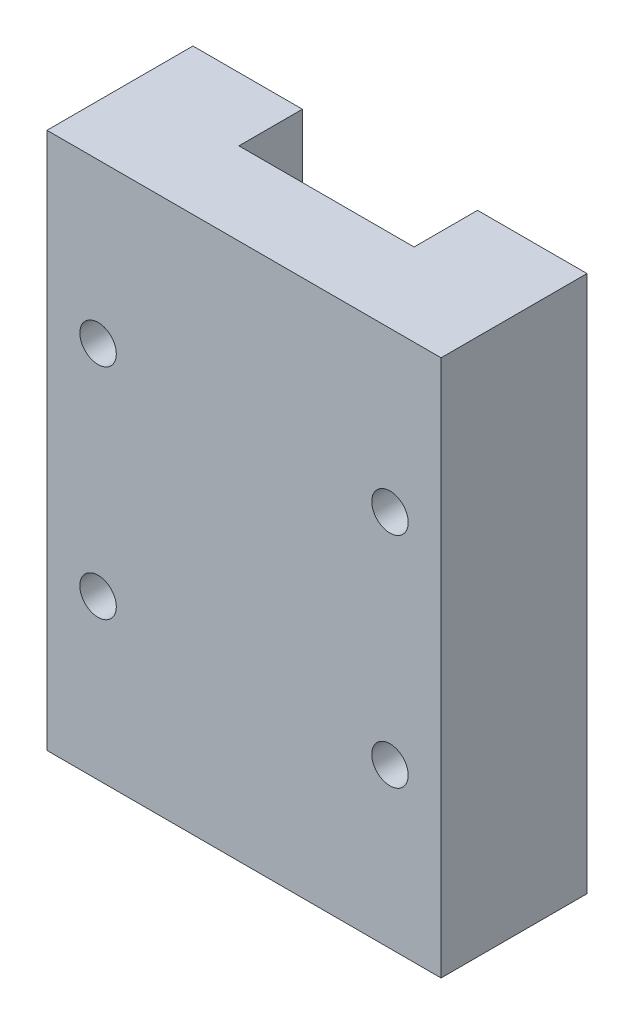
ISO-10303-21;
HEADER;
FILE_DESCRIPTION(('STEP AP214'),'2;1');
FILE_NAME('part.step','',(''),(''),'','','');
FILE_SCHEMA(('AUTOMOTIVE_DESIGN { 1 0 10303 214 1 1 1 1 }'));
ENDSEC;
DATA;
#1=APPLICATION_CONTEXT('core data for automotive mechanical design processes');
#2=APPLICATION_PROTOCOL_DEFINITION('international standard','automotive_design',2000,#1);
#3=PRODUCT_CONTEXT('',#1,'mechanical');
#4=PRODUCT('Part','Part','',(#3));
#5=PRODUCT_RELATED_PRODUCT_CATEGORY('part','',(#4));
#6=PRODUCT_DEFINITION_FORMATION('','',#4);
#7=PRODUCT_DEFINITION_CONTEXT('part definition',#1,'design');
#8=PRODUCT_DEFINITION('design','',#6,#7);
#9=PRODUCT_DEFINITION_SHAPE('','',#8);
#10=(LENGTH_UNIT() NAMED_UNIT(*) SI_UNIT(.MILLI.,.METRE.));
#11=(NAMED_UNIT(*) PLANE_ANGLE_UNIT() SI_UNIT($,.RADIAN.));
#12=(NAMED_UNIT(*) SI_UNIT($,.STERADIAN.) SOLID_ANGLE_UNIT());
#13=UNCERTAINTY_MEASURE_WITH_UNIT(LENGTH_MEASURE(1.E-05),#10,'distance_accuracy_value','');
#14=(GEOMETRIC_REPRESENTATION_CONTEXT(3) GLOBAL_UNCERTAINTY_ASSIGNED_CONTEXT((#13)) GLOBAL_UNIT_ASSIGNED_CONTEXT((#10,
#11,#12)) REPRESENTATION_CONTEXT('',''));
#15=CARTESIAN_POINT('',(0.,0.,0.));
#16=DIRECTION('',(0.,0.,1.));
#17=DIRECTION('',(1.,0.,0.));
#18=AXIS2_PLACEMENT_3D('',#15,#16,#17);
#19=CARTESIAN_POINT('',(0.,36.8000000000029,0.));
#20=DIRECTION('',(0.,0.,1.));
#21=DIRECTION('',(1.,0.,0.));
#22=AXIS2_PLACEMENT_3D('',#19,#20,#21);
#23=PLANE('',#22);
#24=CARTESIAN_POINT('',(23.5,10.9000000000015,0.));
#25=DIRECTION('',(0.,0.,1.));
#26=DIRECTION('',(1.,0.,0.));
#27=AXIS2_PLACEMENT_3D('',#24,#25,#26);
#28=CIRCLE('',#27,1.25);
#29=CARTESIAN_POINT('',(24.75,10.9000000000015,0.));
#30=VERTEX_POINT('',#29);
#31=EDGE_CURVE('E166',#30,#30,#28,.T.);
#32=ORIENTED_EDGE('',*,*,#31,.T.);
#33=EDGE_LOOP('',(#32));
#34=FACE_BOUND('',#33,.T.);
#35=CARTESIAN_POINT('',(23.5,25.9000000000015,0.));
#36=DIRECTION('',(0.,0.,1.));
#37=DIRECTION('',(1.,0.,0.));
#38=AXIS2_PLACEMENT_3D('',#35,#36,#37);
#39=CIRCLE('',#38,1.25);
#40=CARTESIAN_POINT('',(24.75,25.9000000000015,0.));
#41=VERTEX_POINT('',#40);
#42=EDGE_CURVE('E147',#41,#41,#39,.T.);
#43=ORIENTED_EDGE('',*,*,#42,.T.);
#44=EDGE_LOOP('',(#43));
#45=FACE_BOUND('',#44,.T.);
#46=DIRECTION('',(0.,-1.,0.));
#47=VECTOR('',#46,1.);
#48=CARTESIAN_POINT('',(19.4999999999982,95.2064422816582,1.36424205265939E-12));
#49=LINE('',#48,#47);
#50=CARTESIAN_POINT('',(19.4999999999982,36.8000000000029,0.));
#51=VERTEX_POINT('',#50);
#52=CARTESIAN_POINT('',(19.4999999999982,0.,0.));
#53=VERTEX_POINT('',#52);
#54=EDGE_CURVE('E175',#51,#53,#49,.T.);
#55=ORIENTED_EDGE('',*,*,#54,.F.);
#56=DIRECTION('',(-1.,0.,0.));
#57=VECTOR('',#56,1.);
#58=CARTESIAN_POINT('',(27.,36.8000000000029,0.));
#59=LINE('',#58,#57);
#60=CARTESIAN_POINT('',(27.,36.8000000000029,0.));
#61=VERTEX_POINT('',#60);
#62=EDGE_CURVE('E138',#61,#51,#59,.T.);
#63=ORIENTED_EDGE('',*,*,#62,.F.);
#64=DIRECTION('',(0.,1.,0.));
#65=VECTOR('',#64,1.);
#66=CARTESIAN_POINT('',(27.,36.8000000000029,0.));
#67=LINE('',#66,#65);
#68=CARTESIAN_POINT('',(27.,0.,0.));
#69=VERTEX_POINT('',#68);
#70=EDGE_CURVE('E107',#69,#61,#67,.T.);
#71=ORIENTED_EDGE('',*,*,#70,.F.);
#72=DIRECTION('',(1.,0.,0.));
#73=VECTOR('',#72,1.);
#74=CARTESIAN_POINT('',(27.,0.,0.));
#75=LINE('',#74,#73);
#76=EDGE_CURVE('E108',#53,#69,#75,.T.);
#77=ORIENTED_EDGE('',*,*,#76,.F.);
#78=EDGE_LOOP('',(#55,#63,#71,#77));
#79=FACE_BOUND('',#78,.T.);
#80=ADVANCED_FACE('F32',(#34,#45,#79),#23,.F.);
#81=CARTESIAN_POINT('',(3.5,25.9000000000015,0.));
#82=DIRECTION('',(0.,0.,1.));
#83=DIRECTION('',(1.,0.,0.));
#84=AXIS2_PLACEMENT_3D('',#81,#82,#83);
#85=CIRCLE('',#84,1.25);
#86=CARTESIAN_POINT('',(4.75,25.9000000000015,0.));
#87=VERTEX_POINT('',#86);
#88=EDGE_CURVE('E154',#87,#87,#85,.T.);
#89=ORIENTED_EDGE('',*,*,#88,.T.);
#90=EDGE_LOOP('',(#89));
#91=FACE_BOUND('',#90,.T.);
#92=CARTESIAN_POINT('',(3.5,10.9000000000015,0.));
#93=DIRECTION('',(0.,0.,1.));
#94=DIRECTION('',(1.,0.,0.));
#95=AXIS2_PLACEMENT_3D('',#92,#93,#94);
#96=CIRCLE('',#95,1.25);
#97=CARTESIAN_POINT('',(4.75,10.9000000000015,0.));
#98=VERTEX_POINT('',#97);
#99=EDGE_CURVE('E160',#98,#98,#96,.T.);
#100=ORIENTED_EDGE('',*,*,#99,.T.);
#101=EDGE_LOOP('',(#100));
#102=FACE_BOUND('',#101,.T.);
#103=DIRECTION('',(0.,-1.,0.));
#104=VECTOR('',#103,1.);
#105=CARTESIAN_POINT('',(7.49999999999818,95.2064422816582,1.36424205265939E-12));
#106=LINE('',#105,#104);
#107=CARTESIAN_POINT('',(7.49999999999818,36.8000000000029,0.));
#108=VERTEX_POINT('',#107);
#109=CARTESIAN_POINT('',(7.49999999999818,0.,1.36424205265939E-12));
#110=VERTEX_POINT('',#109);
#111=EDGE_CURVE('E112',#108,#110,#106,.T.);
#112=ORIENTED_EDGE('',*,*,#111,.T.);
#113=CARTESIAN_POINT('',(0.,0.,0.));
#114=VERTEX_POINT('',#113);
#115=EDGE_CURVE('E96',#114,#110,#75,.T.);
#116=ORIENTED_EDGE('',*,*,#115,.F.);
#117=DIRECTION('',(0.,-1.,0.));
#118=VECTOR('',#117,1.);
#119=CARTESIAN_POINT('',(0.,36.8000000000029,0.));
#120=LINE('',#119,#118);
#121=CARTESIAN_POINT('',(0.,36.8000000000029,0.));
#122=VERTEX_POINT('',#121);
#123=EDGE_CURVE('E136',#122,#114,#120,.T.);
#124=ORIENTED_EDGE('',*,*,#123,.F.);
#125=EDGE_CURVE('E114',#108,#122,#59,.T.);
#126=ORIENTED_EDGE('',*,*,#125,.F.);
#127=EDGE_LOOP('',(#112,#116,#124,#126));
#128=FACE_BOUND('',#127,.T.);
#129=ADVANCED_FACE('F113',(#91,#102,#128),#23,.F.);
#130=CARTESIAN_POINT('',(27.,36.8000000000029,10.));
#131=DIRECTION('',(0.,-1.,0.));
#132=DIRECTION('',(0.,0.,-1.));
#133=AXIS2_PLACEMENT_3D('',#130,#131,#132);
#134=PLANE('',#133);
#135=DIRECTION('',(0.,0.,-1.));
#136=VECTOR('',#135,1.);
#137=CARTESIAN_POINT('',(19.4999999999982,36.8000000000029,10.));
#138=LINE('',#137,#136);
#139=CARTESIAN_POINT('',(19.4999999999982,36.8000000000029,4.34999999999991));
#140=VERTEX_POINT('',#139);
#141=EDGE_CURVE('E47',#140,#51,#138,.T.);
#142=ORIENTED_EDGE('',*,*,#141,.F.);
#143=DIRECTION('',(1.,0.,0.));
#144=VECTOR('',#143,1.);
#145=CARTESIAN_POINT('',(27.,36.8000000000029,4.34999999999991));
#146=LINE('',#145,#144);
#147=CARTESIAN_POINT('',(7.49999999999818,36.8000000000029,4.34999999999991));
#148=VERTEX_POINT('',#147);
#149=EDGE_CURVE('E51',#148,#140,#146,.T.);
#150=ORIENTED_EDGE('',*,*,#149,.F.);
#151=DIRECTION('',(0.,0.,1.));
#152=VECTOR('',#151,1.);
#153=CARTESIAN_POINT('',(7.49999999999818,36.8000000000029,10.));
#154=LINE('',#153,#152);
#155=EDGE_CURVE('E173',#108,#148,#154,.T.);
#156=ORIENTED_EDGE('',*,*,#155,.F.);
#157=ORIENTED_EDGE('',*,*,#125,.T.);
#158=DIRECTION('',(0.,0.,-1.));
#159=VECTOR('',#158,1.);
#160=CARTESIAN_POINT('',(0.,36.8000000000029,10.));
#161=LINE('',#160,#159);
#162=CARTESIAN_POINT('',(0.,36.8000000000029,10.));
#163=VERTEX_POINT('',#162);
#164=EDGE_CURVE('E121',#163,#122,#161,.T.);
#165=ORIENTED_EDGE('',*,*,#164,.F.);
#166=DIRECTION('',(-1.,0.,0.));
#167=VECTOR('',#166,1.);
#168=CARTESIAN_POINT('',(27.,36.8000000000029,10.));
#169=LINE('',#168,#167);
#170=CARTESIAN_POINT('',(27.,36.8000000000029,10.));
#171=VERTEX_POINT('',#170);
#172=EDGE_CURVE('E134',#171,#163,#169,.T.);
#173=ORIENTED_EDGE('',*,*,#172,.F.);
#174=DIRECTION('',(0.,0.,-1.));
#175=VECTOR('',#174,1.);
#176=CARTESIAN_POINT('',(27.,36.8000000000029,10.));
#177=LINE('',#176,#175);
#178=EDGE_CURVE('E130',#171,#61,#177,.T.);
#179=ORIENTED_EDGE('',*,*,#178,.T.);
#180=ORIENTED_EDGE('',*,*,#62,.T.);
#181=EDGE_LOOP('',(#142,#150,#156,#157,#165,#173,#179,#180));
#182=FACE_BOUND('',#181,.T.);
#183=ADVANCED_FACE('F34',(#182),#134,.F.);
#184=CARTESIAN_POINT('',(27.,0.,10.));
#185=DIRECTION('',(0.,1.,0.));
#186=DIRECTION('',(0.,0.,1.));
#187=AXIS2_PLACEMENT_3D('',#184,#185,#186);
#188=PLANE('',#187);
#189=DIRECTION('',(0.,0.,1.));
#190=VECTOR('',#189,1.);
#191=CARTESIAN_POINT('',(19.4999999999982,0.,10.));
#192=LINE('',#191,#190);
#193=CARTESIAN_POINT('',(19.4999999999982,0.,4.34999999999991));
#194=VERTEX_POINT('',#193);
#195=EDGE_CURVE('E11',#53,#194,#192,.T.);
#196=ORIENTED_EDGE('',*,*,#195,.F.);
#197=ORIENTED_EDGE('',*,*,#76,.T.);
#198=DIRECTION('',(0.,0.,-1.));
#199=VECTOR('',#198,1.);
#200=CARTESIAN_POINT('',(27.,0.,10.));
#201=LINE('',#200,#199);
#202=CARTESIAN_POINT('',(27.,0.,10.));
#203=VERTEX_POINT('',#202);
#204=EDGE_CURVE('E127',#203,#69,#201,.T.);
#205=ORIENTED_EDGE('',*,*,#204,.F.);
#206=DIRECTION('',(1.,0.,0.));
#207=VECTOR('',#206,1.);
#208=CARTESIAN_POINT('',(27.,0.,10.));
#209=LINE('',#208,#207);
#210=CARTESIAN_POINT('',(0.,0.,10.));
#211=VERTEX_POINT('',#210);
#212=EDGE_CURVE('E141',#211,#203,#209,.T.);
#213=ORIENTED_EDGE('',*,*,#212,.F.);
#214=DIRECTION('',(0.,0.,-1.));
#215=VECTOR('',#214,1.);
#216=CARTESIAN_POINT('',(0.,0.,10.));
#217=LINE('',#216,#215);
#218=EDGE_CURVE('E104',#211,#114,#217,.T.);
#219=ORIENTED_EDGE('',*,*,#218,.T.);
#220=ORIENTED_EDGE('',*,*,#115,.T.);
#221=DIRECTION('',(0.,0.,-1.));
#222=VECTOR('',#221,1.);
#223=CARTESIAN_POINT('',(7.49999999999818,0.,10.));
#224=LINE('',#223,#222);
#225=CARTESIAN_POINT('',(7.49999999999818,0.,4.34999999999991));
#226=VERTEX_POINT('',#225);
#227=EDGE_CURVE('E100',#226,#110,#224,.T.);
#228=ORIENTED_EDGE('',*,*,#227,.F.);
#229=DIRECTION('',(-1.,0.,0.));
#230=VECTOR('',#229,1.);
#231=CARTESIAN_POINT('',(27.,0.,4.34999999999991));
#232=LINE('',#231,#230);
#233=EDGE_CURVE('E40',#194,#226,#232,.T.);
#234=ORIENTED_EDGE('',*,*,#233,.F.);
#235=EDGE_LOOP('',(#196,#197,#205,#213,#219,#220,#228,#234));
#236=FACE_BOUND('',#235,.T.);
#237=ADVANCED_FACE('F98',(#236),#188,.F.);
#238=CARTESIAN_POINT('',(0.,36.8000000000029,10.));
#239=DIRECTION('',(0.,0.,1.));
#240=DIRECTION('',(1.,0.,0.));
#241=AXIS2_PLACEMENT_3D('',#238,#239,#240);
#242=PLANE('',#241);
#243=CARTESIAN_POINT('',(3.5,10.9000000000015,10.));
#244=DIRECTION('',(0.,0.,1.));
#245=DIRECTION('',(1.,0.,0.));
#246=AXIS2_PLACEMENT_3D('',#243,#244,#245);
#247=CIRCLE('',#246,1.25);
#248=CARTESIAN_POINT('',(4.75,10.9000000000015,10.));
#249=VERTEX_POINT('',#248);
#250=EDGE_CURVE('E157',#249,#249,#247,.T.);
#251=ORIENTED_EDGE('',*,*,#250,.F.);
#252=EDGE_LOOP('',(#251));
#253=FACE_BOUND('',#252,.T.);
#254=CARTESIAN_POINT('',(23.5,25.9000000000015,10.));
#255=DIRECTION('',(0.,0.,1.));
#256=DIRECTION('',(1.,0.,0.));
#257=AXIS2_PLACEMENT_3D('',#254,#255,#256);
#258=CIRCLE('',#257,1.25);
#259=CARTESIAN_POINT('',(24.75,25.9000000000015,10.));
#260=VERTEX_POINT('',#259);
#261=EDGE_CURVE('E150',#260,#260,#258,.T.);
#262=ORIENTED_EDGE('',*,*,#261,.F.);
#263=EDGE_LOOP('',(#262));
#264=FACE_BOUND('',#263,.T.);
#265=ORIENTED_EDGE('',*,*,#172,.T.);
#266=DIRECTION('',(0.,-1.,0.));
#267=VECTOR('',#266,1.);
#268=CARTESIAN_POINT('',(0.,36.8000000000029,10.));
#269=LINE('',#268,#267);
#270=EDGE_CURVE('E143',#163,#211,#269,.T.);
#271=ORIENTED_EDGE('',*,*,#270,.T.);
#272=ORIENTED_EDGE('',*,*,#212,.T.);
#273=DIRECTION('',(0.,1.,0.));
#274=VECTOR('',#273,1.);
#275=CARTESIAN_POINT('',(27.,36.8000000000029,10.));
#276=LINE('',#275,#274);
#277=EDGE_CURVE('E133',#203,#171,#276,.T.);
#278=ORIENTED_EDGE('',*,*,#277,.T.);
#279=EDGE_LOOP('',(#265,#271,#272,#278));
#280=FACE_BOUND('',#279,.T.);
#281=CARTESIAN_POINT('',(3.5,25.9000000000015,10.));
#282=DIRECTION('',(0.,0.,1.));
#283=DIRECTION('',(1.,0.,0.));
#284=AXIS2_PLACEMENT_3D('',#281,#282,#283);
#285=CIRCLE('',#284,1.25);
#286=CARTESIAN_POINT('',(4.75,25.9000000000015,10.));
#287=VERTEX_POINT('',#286);
#288=EDGE_CURVE('E151',#287,#287,#285,.T.);
#289=ORIENTED_EDGE('',*,*,#288,.F.);
#290=EDGE_LOOP('',(#289));
#291=FACE_BOUND('',#290,.T.);
#292=CARTESIAN_POINT('',(23.5,10.9000000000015,10.));
#293=DIRECTION('',(0.,0.,1.));
#294=DIRECTION('',(1.,0.,0.));
#295=AXIS2_PLACEMENT_3D('',#292,#293,#294);
#296=CIRCLE('',#295,1.25);
#297=CARTESIAN_POINT('',(24.75,10.9000000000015,10.));
#298=VERTEX_POINT('',#297);
#299=EDGE_CURVE('E163',#298,#298,#296,.T.);
#300=ORIENTED_EDGE('',*,*,#299,.F.);
#301=EDGE_LOOP('',(#300));
#302=FACE_BOUND('',#301,.T.);
#303=ADVANCED_FACE('F198',(#253,#264,#280,#291,#302),#242,.T.);
#304=CARTESIAN_POINT('',(0.,36.8000000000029,10.));
#305=DIRECTION('',(1.,0.,0.));
#306=DIRECTION('',(0.,0.,-1.));
#307=AXIS2_PLACEMENT_3D('',#304,#305,#306);
#308=PLANE('',#307);
#309=ORIENTED_EDGE('',*,*,#123,.T.);
#310=ORIENTED_EDGE('',*,*,#218,.F.);
#311=ORIENTED_EDGE('',*,*,#270,.F.);
#312=ORIENTED_EDGE('',*,*,#164,.T.);
#313=EDGE_LOOP('',(#309,#310,#311,#312));
#314=FACE_BOUND('',#313,.T.);
#315=ADVANCED_FACE('F201',(#314),#308,.F.);
#316=CARTESIAN_POINT('',(27.,36.8000000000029,10.));
#317=DIRECTION('',(-1.,0.,0.));
#318=DIRECTION('',(0.,0.,1.));
#319=AXIS2_PLACEMENT_3D('',#316,#317,#318);
#320=PLANE('',#319);
#321=ORIENTED_EDGE('',*,*,#70,.T.);
#322=ORIENTED_EDGE('',*,*,#178,.F.);
#323=ORIENTED_EDGE('',*,*,#277,.F.);
#324=ORIENTED_EDGE('',*,*,#204,.T.);
#325=EDGE_LOOP('',(#321,#322,#323,#324));
#326=FACE_BOUND('',#325,.T.);
#327=ADVANCED_FACE('F193',(#326),#320,.F.);
#328=CARTESIAN_POINT('',(23.5,25.9000000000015,10.));
#329=DIRECTION('',(0.,0.,-1.));
#330=DIRECTION('',(-1.,0.,0.));
#331=AXIS2_PLACEMENT_3D('',#328,#329,#330);
#332=CYLINDRICAL_SURFACE('',#331,1.25);
#333=ORIENTED_EDGE('',*,*,#261,.T.);
#334=EDGE_LOOP('',(#333));
#335=FACE_BOUND('',#334,.T.);
#336=ORIENTED_EDGE('',*,*,#42,.F.);
#337=EDGE_LOOP('',(#336));
#338=FACE_BOUND('',#337,.T.);
#339=ADVANCED_FACE('F207',(#335,#338),#332,.F.);
#340=CARTESIAN_POINT('',(3.5,25.9000000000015,10.));
#341=DIRECTION('',(0.,0.,-1.));
#342=DIRECTION('',(-1.,0.,0.));
#343=AXIS2_PLACEMENT_3D('',#340,#341,#342);
#344=CYLINDRICAL_SURFACE('',#343,1.25);
#345=ORIENTED_EDGE('',*,*,#288,.T.);
#346=EDGE_LOOP('',(#345));
#347=FACE_BOUND('',#346,.T.);
#348=ORIENTED_EDGE('',*,*,#88,.F.);
#349=EDGE_LOOP('',(#348));
#350=FACE_BOUND('',#349,.T.);
#351=ADVANCED_FACE('F258',(#347,#350),#344,.F.);
#352=CARTESIAN_POINT('',(3.5,10.9000000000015,10.));
#353=DIRECTION('',(0.,0.,-1.));
#354=DIRECTION('',(-1.,0.,0.));
#355=AXIS2_PLACEMENT_3D('',#352,#353,#354);
#356=CYLINDRICAL_SURFACE('',#355,1.25);
#357=ORIENTED_EDGE('',*,*,#250,.T.);
#358=EDGE_LOOP('',(#357));
#359=FACE_BOUND('',#358,.T.);
#360=ORIENTED_EDGE('',*,*,#99,.F.);
#361=EDGE_LOOP('',(#360));
#362=FACE_BOUND('',#361,.T.);
#363=ADVANCED_FACE('F246',(#359,#362),#356,.F.);
#364=CARTESIAN_POINT('',(23.5,10.9000000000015,10.));
#365=DIRECTION('',(0.,0.,-1.));
#366=DIRECTION('',(-1.,0.,0.));
#367=AXIS2_PLACEMENT_3D('',#364,#365,#366);
#368=CYLINDRICAL_SURFACE('',#367,1.25);
#369=ORIENTED_EDGE('',*,*,#299,.T.);
#370=EDGE_LOOP('',(#369));
#371=FACE_BOUND('',#370,.T.);
#372=ORIENTED_EDGE('',*,*,#31,.F.);
#373=EDGE_LOOP('',(#372));
#374=FACE_BOUND('',#373,.T.);
#375=ADVANCED_FACE('F241',(#371,#374),#368,.F.);
#376=CARTESIAN_POINT('',(19.4999999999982,95.2064422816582,1.36424205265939E-12));
#377=DIRECTION('',(-1.,0.,0.));
#378=DIRECTION('',(0.,0.,1.));
#379=AXIS2_PLACEMENT_3D('',#376,#377,#378);
#380=PLANE('',#379);
#381=DIRECTION('',(0.,-1.,0.));
#382=VECTOR('',#381,1.);
#383=CARTESIAN_POINT('',(19.4999999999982,95.2064422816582,4.34999999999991));
#384=LINE('',#383,#382);
#385=EDGE_CURVE('E178',#140,#194,#384,.T.);
#386=ORIENTED_EDGE('',*,*,#385,.F.);
#387=ORIENTED_EDGE('',*,*,#141,.T.);
#388=ORIENTED_EDGE('',*,*,#54,.T.);
#389=ORIENTED_EDGE('',*,*,#195,.T.);
#390=EDGE_LOOP('',(#386,#387,#388,#389));
#391=FACE_BOUND('',#390,.T.);
#392=ADVANCED_FACE('F185',(#391),#380,.T.);
#393=CARTESIAN_POINT('',(19.4999999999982,95.2064422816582,4.34999999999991));
#394=DIRECTION('',(0.,0.,-1.));
#395=DIRECTION('',(-1.,0.,0.));
#396=AXIS2_PLACEMENT_3D('',#393,#394,#395);
#397=PLANE('',#396);
#398=DIRECTION('',(0.,-1.,0.));
#399=VECTOR('',#398,1.);
#400=CARTESIAN_POINT('',(7.49999999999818,95.2064422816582,4.34999999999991));
#401=LINE('',#400,#399);
#402=EDGE_CURVE('E116',#148,#226,#401,.T.);
#403=ORIENTED_EDGE('',*,*,#402,.F.);
#404=ORIENTED_EDGE('',*,*,#149,.T.);
#405=ORIENTED_EDGE('',*,*,#385,.T.);
#406=ORIENTED_EDGE('',*,*,#233,.T.);
#407=EDGE_LOOP('',(#403,#404,#405,#406));
#408=FACE_BOUND('',#407,.T.);
#409=ADVANCED_FACE('F183',(#408),#397,.T.);
#410=CARTESIAN_POINT('',(7.49999999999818,95.2064422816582,1.36424205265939E-12));
#411=DIRECTION('',(1.,0.,0.));
#412=DIRECTION('',(0.,0.,-1.));
#413=AXIS2_PLACEMENT_3D('',#410,#411,#412);
#414=PLANE('',#413);
#415=ORIENTED_EDGE('',*,*,#111,.F.);
#416=ORIENTED_EDGE('',*,*,#155,.T.);
#417=ORIENTED_EDGE('',*,*,#402,.T.);
#418=ORIENTED_EDGE('',*,*,#227,.T.);
#419=EDGE_LOOP('',(#415,#416,#417,#418));
#420=FACE_BOUND('',#419,.T.);
#421=ADVANCED_FACE('F119',(#420),#414,.T.);
#422=CLOSED_SHELL('',(#80,#129,#183,#237,#303,#315,#327,#339,#351,#363,#375,#392,#409,#421));
#423=MANIFOLD_SOLID_BREP('B2',#422);
#424=ADVANCED_BREP_SHAPE_REPRESENTATION('',(#18,#423),#14);
#425=SHAPE_DEFINITION_REPRESENTATION(#9,#424);
ENDSEC;
END-ISO-10303-21;
